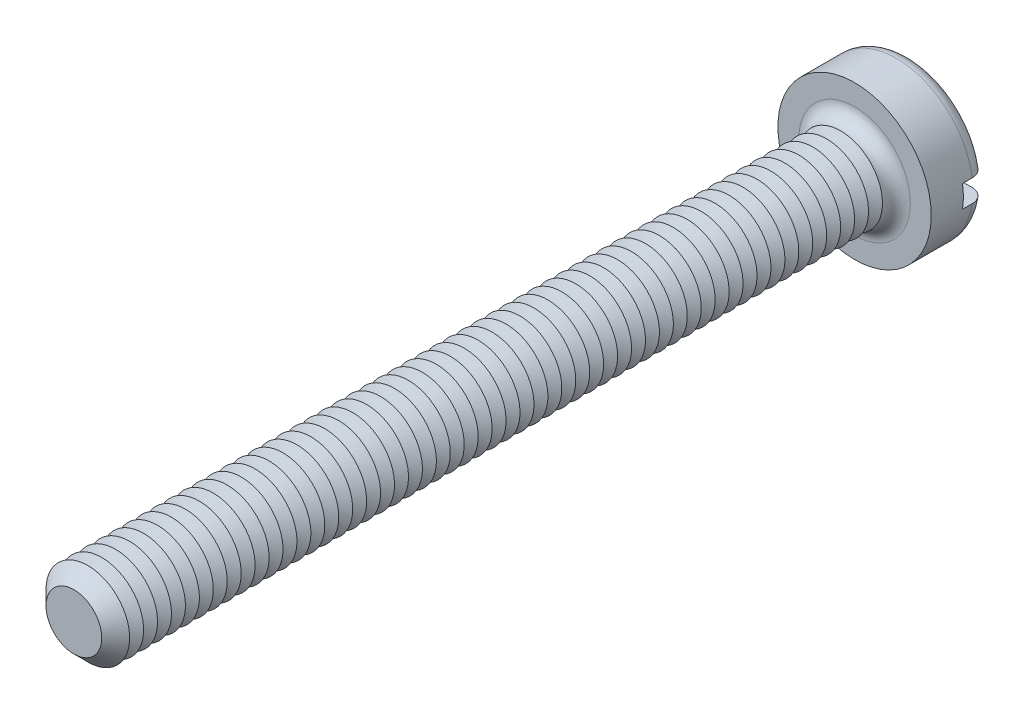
from build123d import *

# Parameters (mm, degrees)
SKETCH3_R           = 2.75
BOSS_EXTRUDE2_DEPTH = 2
SKETCH4_R           = 1.5
BOSS_EXTRUDE3_DEPTH = 28
FILLET1_R           = 0.5
CHAMFER1_SIZE       = 0.5
LPATTERN1_COUNT     = 54
LPATTERN1_PITCH     = 0.5
SKETCH8_W           = 5.5
SKETCH8_H           = 0.8
CUT_EXTRUDE1_DEPTH  = 0.85


with BuildPart() as part:
    # Sketch3 → Boss-Extrude2 (new body)
    with BuildSketch(Plane.XY):
        Circle(SKETCH3_R)
    extrude(amount=-BOSS_EXTRUDE2_DEPTH)

    # Sketch4 → Boss-Extrude3 (add)
    with BuildSketch(Plane.XY):
        Circle(SKETCH4_R)
    extrude(amount=BOSS_EXTRUDE3_DEPTH)

    # Fillet1
    fillet1_edges = [part.edges().sort_by_distance(p)[0] for p in [
        (-2.75, 0, -2),
        (-1.5, 0, 0),
    ]]
    fillet(fillet1_edges, radius=FILLET1_R)

    # Chamfer1
    chamfer1_edges = [part.edges().sort_by_distance(p)[0] for p in [
        (-1.5, 0, 28),
    ]]
    chamfer(chamfer1_edges, length=CHAMFER1_SIZE)

    # Sketch6 → Cut-Revolve1 (revolve, cut)
    with BuildSketch(Plane(origin=(0, 0, 0), x_dir=(0, 0, -1), z_dir=(1, 0, 0)), mode=Mode.PRIVATE) as cut_revolve1_sk:
        Polygon((-0.5, 1.5), (-0.75, 1.066987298), (-1, 1.5), align=None)
    cut_revolve1 = revolve(cut_revolve1_sk.sketch.rotate(Axis((0, 0, -1.694361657), (0, 0, 1)), 90), axis=Axis((0, 0, -1.694361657), (0, 0, 1)), mode=Mode.SUBTRACT)

    # LPattern1: Cut-Revolve1 ×54
    with Locations(*[(0, 0, i * LPATTERN1_PITCH) for i in range(1, LPATTERN1_COUNT)]):
        add(cut_revolve1, mode=Mode.SUBTRACT)

    # Sketch8 → Cut-Extrude1 (cut)
    with BuildSketch(Plane(origin=(0, 0, -2), x_dir=(-1, 0, 0), z_dir=(0, 0, -1))):
        Rectangle(SKETCH8_W, SKETCH8_H)
    extrude(amount=-CUT_EXTRUDE1_DEPTH, mode=Mode.SUBTRACT)


solid = part.part
